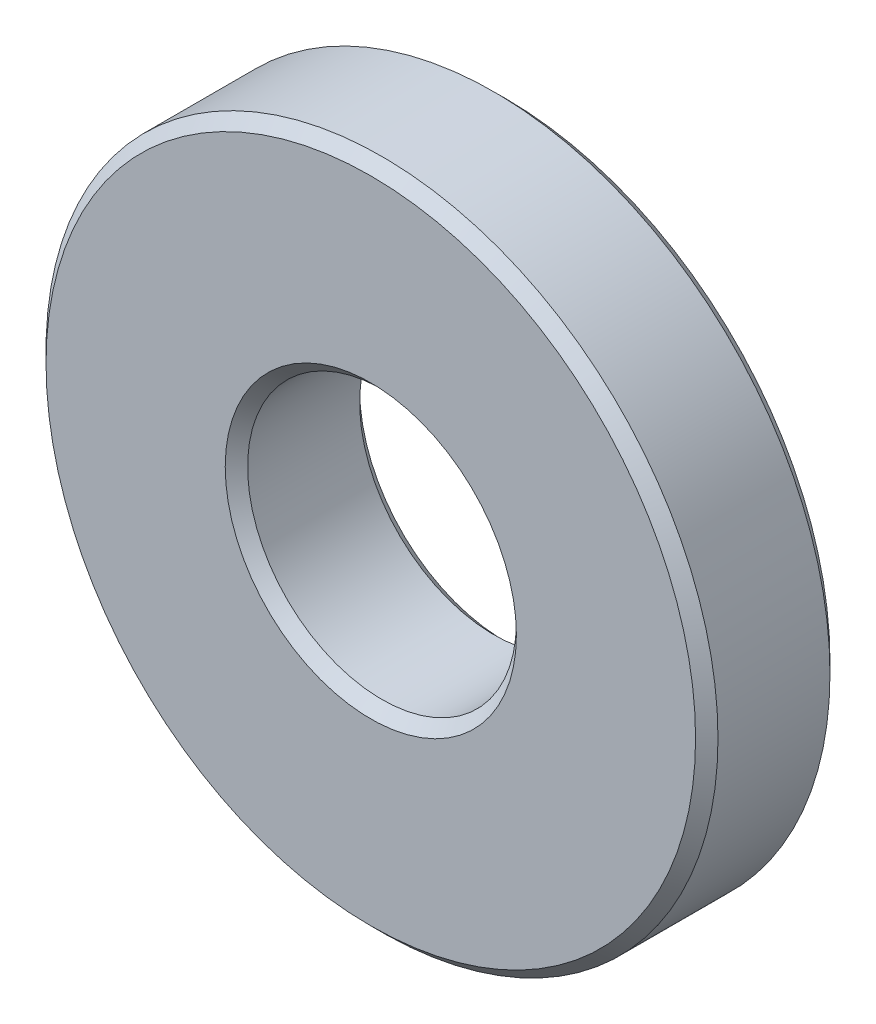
from build123d import *

# Parameters (mm, degrees)
SKETCH_1_R      = 7.5
SKETCH_1_R_2    = 3
EXTRUDE_1_DEPTH = 3
CHAMFER_1_SIZE  = 0.25


with BuildPart() as part:
    # Sketch 1 → Extrude 1 (new body)
    with BuildSketch(Plane.XY):
        Circle(SKETCH_1_R)
        Circle(SKETCH_1_R_2, mode=Mode.SUBTRACT)
    extrude(amount=EXTRUDE_1_DEPTH)

    # Chamfer 1
    chamfer_1_edges = [part.edges().sort_by_distance(p)[0] for p in [
        (-7.5, 0, 0),
        (-7.5, 0, 3),
        (-3, 0, 0),
        (-3, 0, 3),
    ]]
    chamfer(chamfer_1_edges, length=CHAMFER_1_SIZE)


solid = part.part
